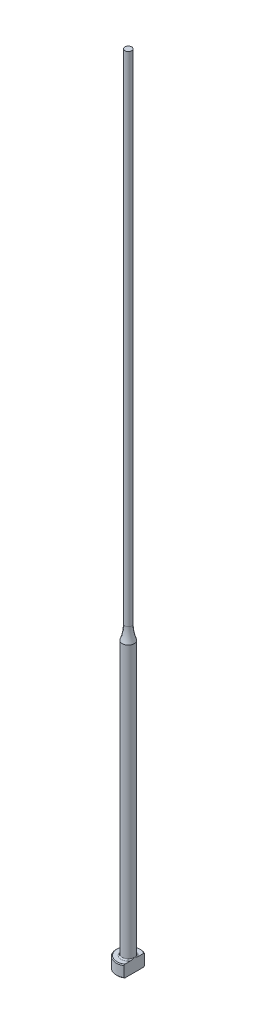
from build123d import *
from build123d.topology import SkipClean

# Parameters (mm, degrees)
CHAMFER1_SIZE = 0.2
FILLET1_R     = 0.3
KEY_DEPTH     = 201.044994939


with BuildPart() as part:
    # Sketch1 → Revolve1 (revolve)
    with BuildSketch(Plane.XY, mode=Mode.PRIVATE) as revolve1_sk:
        with BuildLine():
            Line((0, 0), (-3, 0))
            Line((-3, 0), (-3, 3))
            Line((-3, 3), (-1.5, 3))
            Line((-1.5, 3), (-1.5, 71.453522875))
            ThreePointArc((-1.5, 71.453522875), (-1.013842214, 73.197224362), (-0.85, 75))
            Line((-0.85, 75), (-0.85, 200))
            Line((-0.85, 200), (0, 200))
            Line((0, 200), (0, 0))
        make_face()
    revolve(revolve1_sk.sketch.rotate(Axis((0, 259.958771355, 0), (0, -1, 0)), 270), axis=Axis((0, 259.958771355, 0), (0, -1, 0)))

    # Chamfer1
    chamfer1_edges = [part.edges().sort_by_distance(p)[0] for p in [
        (0, 0, -3),
        (0, 3, -3),
    ]]
    chamfer(chamfer1_edges, length=CHAMFER1_SIZE)

    # Fillet1
    fillet1_edges = [part.edges().sort_by_distance(p)[0] for p in [
        (0, 3, -1.5),
    ]]
    fillet(fillet1_edges, radius=FILLET1_R)

    # Sketch2 → KEY (cut, through all)
    with SkipClean():  # the faces are left unmerged after this step: merging them gives an invalid solid
        with BuildSketch(Plane(origin=(0, 0, 0), x_dir=(1, 0, 0), z_dir=(0, 1, 0))):
            with BuildLine():
                Line((1.5, 2.598076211), (1.5, -2.598076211))
                ThreePointArc((1.5, -2.598076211), (3, 0), (1.5, 2.598076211))
            make_face()
        extrude(amount=KEY_DEPTH, mode=Mode.SUBTRACT)


solid = part.part
